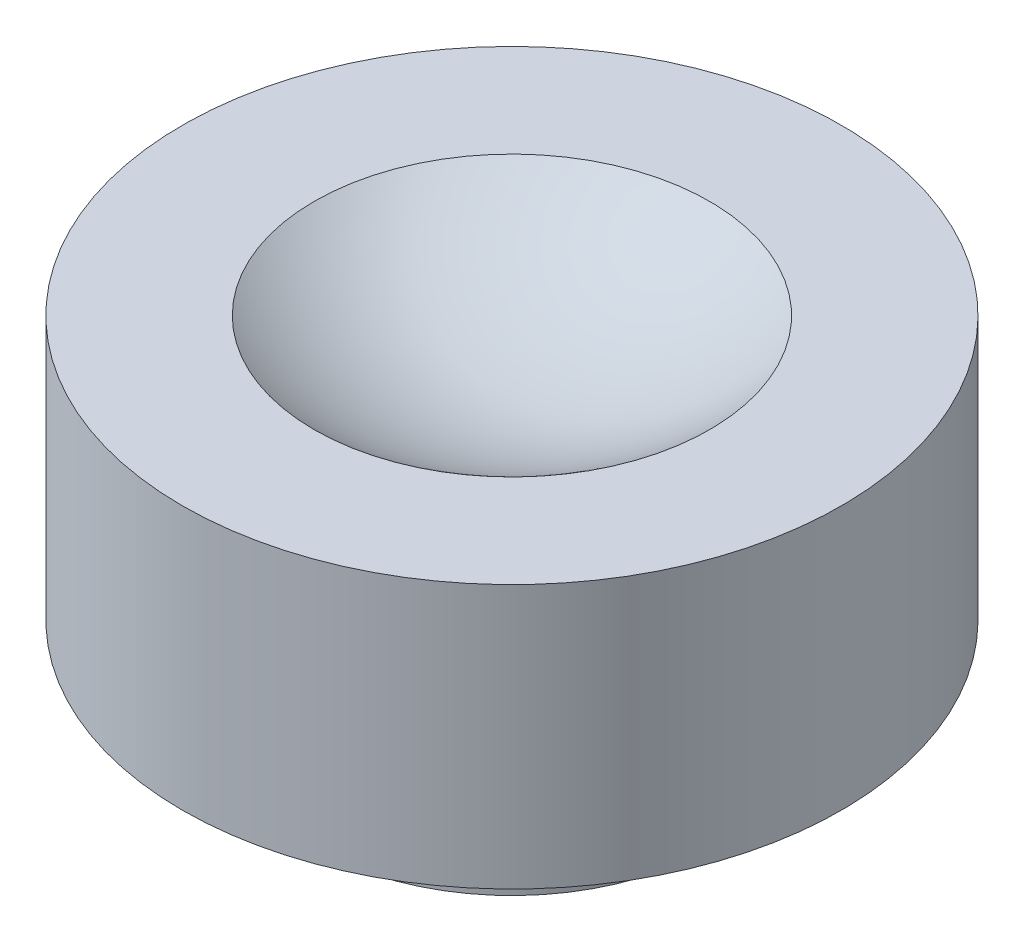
from build123d import *


with BuildPart() as part:
    # Esquisse1 → Base-R_volution (revolve)
    with BuildSketch(Plane.XY, mode=Mode.PRIVATE) as base_r_volution_sk:
        with BuildLine():
            Line((0, 34.5), (0, 39))
            ThreePointArc((0, 39), (-1.58113883, 39.25658351), (-3, 40))
            Line((-3, 40), (-5, 40))
            Line((-5, 40), (-5, 36))
            Line((-5, 36), (-3, 36))
            Line((-3, 36), (-3, 34.5))
            Line((-3, 34.5), (0, 34.5))
        make_face()
    revolve(base_r_volution_sk.sketch.rotate(Axis((0, 60, 0), (0, -1, 0)), 270), axis=Axis((0, 60, 0), (0, -1, 0)))


solid = part.part
